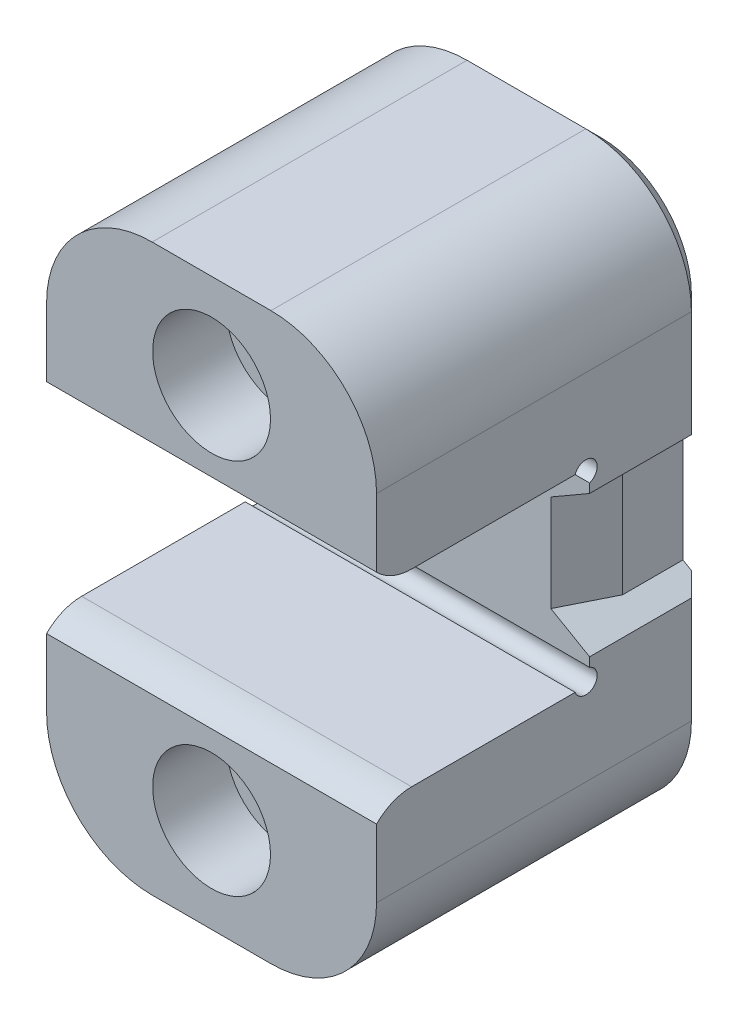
ISO-10303-21;
HEADER;
FILE_DESCRIPTION(('STEP AP214'),'2;1');
FILE_NAME('part.step','',(''),(''),'','','');
FILE_SCHEMA(('AUTOMOTIVE_DESIGN { 1 0 10303 214 1 1 1 1 }'));
ENDSEC;
DATA;
#1=APPLICATION_CONTEXT('core data for automotive mechanical design processes');
#2=APPLICATION_PROTOCOL_DEFINITION('international standard','automotive_design',2000,#1);
#3=PRODUCT_CONTEXT('',#1,'mechanical');
#4=PRODUCT('Part','Part','',(#3));
#5=PRODUCT_RELATED_PRODUCT_CATEGORY('part','',(#4));
#6=PRODUCT_DEFINITION_FORMATION('','',#4);
#7=PRODUCT_DEFINITION_CONTEXT('part definition',#1,'design');
#8=PRODUCT_DEFINITION('design','',#6,#7);
#9=PRODUCT_DEFINITION_SHAPE('','',#8);
#10=(LENGTH_UNIT() NAMED_UNIT(*) SI_UNIT(.MILLI.,.METRE.));
#11=(NAMED_UNIT(*) PLANE_ANGLE_UNIT() SI_UNIT($,.RADIAN.));
#12=(NAMED_UNIT(*) SI_UNIT($,.STERADIAN.) SOLID_ANGLE_UNIT());
#13=UNCERTAINTY_MEASURE_WITH_UNIT(LENGTH_MEASURE(1.E-05),#10,'distance_accuracy_value','');
#14=(GEOMETRIC_REPRESENTATION_CONTEXT(3) GLOBAL_UNCERTAINTY_ASSIGNED_CONTEXT((#13)) GLOBAL_UNIT_ASSIGNED_CONTEXT((#10,
#11,#12)) REPRESENTATION_CONTEXT('',''));
#15=CARTESIAN_POINT('',(0.,0.,0.));
#16=DIRECTION('',(0.,0.,1.));
#17=DIRECTION('',(1.,0.,0.));
#18=AXIS2_PLACEMENT_3D('',#15,#16,#17);
#19=CARTESIAN_POINT('',(11.1125,6.35,-14.351));
#20=DIRECTION('',(0.,0.,-1.));
#21=DIRECTION('',(-1.,0.,0.));
#22=AXIS2_PLACEMENT_3D('',#19,#20,#21);
#23=PLANE('',#22);
#24=DIRECTION('',(0.866025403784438,-0.500000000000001,0.));
#25=VECTOR('',#24,1.);
#26=CARTESIAN_POINT('',(6.30064635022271,-1.98437499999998,-14.351));
#27=LINE('',#26,#25);
#28=CARTESIAN_POINT('',(8.50411357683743,-3.25654739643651,-14.351));
#29=VERTEX_POINT('',#28);
#30=CARTESIAN_POINT('',(11.1125,-4.76249999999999,-14.351));
#31=VERTEX_POINT('',#30);
#32=EDGE_CURVE('E427',#29,#31,#27,.T.);
#33=ORIENTED_EDGE('',*,*,#32,.F.);
#34=DIRECTION('',(0.,1.,0.));
#35=VECTOR('',#34,1.);
#36=CARTESIAN_POINT('',(8.50411357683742,3.84595644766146,-14.351));
#37=LINE('',#36,#35);
#38=CARTESIAN_POINT('',(8.50411357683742,3.25654739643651,-14.351));
#39=VERTEX_POINT('',#38);
#40=EDGE_CURVE('E285',#29,#39,#37,.T.);
#41=ORIENTED_EDGE('',*,*,#40,.T.);
#42=DIRECTION('',(-0.866025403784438,-0.500000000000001,0.));
#43=VECTOR('',#42,1.);
#44=CARTESIAN_POINT('',(11.7999076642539,5.159375,-14.351));
#45=LINE('',#44,#43);
#46=CARTESIAN_POINT('',(11.1125,4.7625,-14.351));
#47=VERTEX_POINT('',#46);
#48=EDGE_CURVE('E425',#47,#39,#45,.T.);
#49=ORIENTED_EDGE('',*,*,#48,.F.);
#50=DIRECTION('',(0.,-1.,0.));
#51=VECTOR('',#50,1.);
#52=CARTESIAN_POINT('',(11.1125,6.35,-14.351));
#53=LINE('',#52,#51);
#54=CARTESIAN_POINT('',(11.1125,5.37757951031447,-14.351));
#55=VERTEX_POINT('',#54);
#56=EDGE_CURVE('E436',#55,#47,#53,.T.);
#57=ORIENTED_EDGE('',*,*,#56,.F.);
#58=DIRECTION('',(1.,0.,0.));
#59=VECTOR('',#58,1.);
#60=CARTESIAN_POINT('',(-11.1125,5.37757951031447,-14.351));
#61=LINE('',#60,#59);
#62=CARTESIAN_POINT('',(-11.1125,5.37757951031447,-14.351));
#63=VERTEX_POINT('',#62);
#64=EDGE_CURVE('E391',#55,#63,#61,.F.);
#65=ORIENTED_EDGE('',*,*,#64,.T.);
#66=DIRECTION('',(0.,-1.,0.));
#67=VECTOR('',#66,1.);
#68=CARTESIAN_POINT('',(-11.1125,6.35,-14.351));
#69=LINE('',#68,#67);
#70=CARTESIAN_POINT('',(-11.1125,-5.37757951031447,-14.351));
#71=VERTEX_POINT('',#70);
#72=EDGE_CURVE('E232',#63,#71,#69,.T.);
#73=ORIENTED_EDGE('',*,*,#72,.T.);
#74=DIRECTION('',(1.,0.,0.));
#75=VECTOR('',#74,1.);
#76=CARTESIAN_POINT('',(-11.1125,-5.37757951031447,-14.351));
#77=LINE('',#76,#75);
#78=CARTESIAN_POINT('',(11.1125,-5.37757951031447,-14.351));
#79=VERTEX_POINT('',#78);
#80=EDGE_CURVE('E212',#71,#79,#77,.T.);
#81=ORIENTED_EDGE('',*,*,#80,.T.);
#82=EDGE_CURVE('E435',#31,#79,#53,.T.);
#83=ORIENTED_EDGE('',*,*,#82,.F.);
#84=EDGE_LOOP('',(#33,#41,#49,#57,#65,#73,#81,#83));
#85=FACE_BOUND('',#84,.T.);
#86=ADVANCED_FACE('F32',(#85),#23,.F.);
#87=CARTESIAN_POINT('',(11.1125,19.05,-22.225));
#88=DIRECTION('',(0.,0.,1.));
#89=DIRECTION('',(1.,0.,0.));
#90=AXIS2_PLACEMENT_3D('',#87,#88,#89);
#91=PLANE('',#90);
#92=DIRECTION('',(0.866025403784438,-0.500000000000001,0.));
#93=VECTOR('',#92,1.);
#94=CARTESIAN_POINT('',(9.525,-3.84595644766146,-22.225));
#95=LINE('',#94,#93);
#96=CARTESIAN_POINT('',(9.525,-3.84595644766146,-22.225));
#97=VERTEX_POINT('',#96);
#98=CARTESIAN_POINT('',(10.0965,-4.17591212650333,-22.225));
#99=VERTEX_POINT('',#98);
#100=EDGE_CURVE('E415',#97,#99,#95,.T.);
#101=ORIENTED_EDGE('',*,*,#100,.T.);
#102=DIRECTION('',(0.,-1.,0.));
#103=VECTOR('',#102,1.);
#104=CARTESIAN_POINT('',(10.0965,19.05,-22.225));
#105=LINE('',#104,#103);
#106=CARTESIAN_POINT('',(10.0965,-11.938,-22.225));
#107=VERTEX_POINT('',#106);
#108=EDGE_CURVE('E314',#99,#107,#105,.T.);
#109=ORIENTED_EDGE('',*,*,#108,.T.);
#110=CARTESIAN_POINT('',(4.0005,-11.938,-22.225));
#111=DIRECTION('',(0.,0.,1.));
#112=DIRECTION('',(1.,0.,0.));
#113=AXIS2_PLACEMENT_3D('',#110,#111,#112);
#114=CIRCLE('',#113,6.096);
#115=CARTESIAN_POINT('',(4.0005,-18.034,-22.225));
#116=VERTEX_POINT('',#115);
#117=EDGE_CURVE('E310',#107,#116,#114,.F.);
#118=ORIENTED_EDGE('',*,*,#117,.T.);
#119=DIRECTION('',(-1.,0.,0.));
#120=VECTOR('',#119,1.);
#121=CARTESIAN_POINT('',(11.1125,-18.034,-22.225));
#122=LINE('',#121,#120);
#123=CARTESIAN_POINT('',(-4.0005,-18.034,-22.225));
#124=VERTEX_POINT('',#123);
#125=EDGE_CURVE('E306',#116,#124,#122,.T.);
#126=ORIENTED_EDGE('',*,*,#125,.T.);
#127=CARTESIAN_POINT('',(-4.0005,-11.938,-22.225));
#128=DIRECTION('',(0.,0.,1.));
#129=DIRECTION('',(1.,0.,0.));
#130=AXIS2_PLACEMENT_3D('',#127,#128,#129);
#131=CIRCLE('',#130,6.09599999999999);
#132=CARTESIAN_POINT('',(-10.0965,-11.938,-22.225));
#133=VERTEX_POINT('',#132);
#134=EDGE_CURVE('E304',#124,#133,#131,.F.);
#135=ORIENTED_EDGE('',*,*,#134,.T.);
#136=DIRECTION('',(0.,1.,0.));
#137=VECTOR('',#136,1.);
#138=CARTESIAN_POINT('',(-10.0965,11.938,-22.225));
#139=LINE('',#138,#137);
#140=CARTESIAN_POINT('',(-10.0965,11.938,-22.225));
#141=VERTEX_POINT('',#140);
#142=EDGE_CURVE('E300',#133,#141,#139,.T.);
#143=ORIENTED_EDGE('',*,*,#142,.T.);
#144=CARTESIAN_POINT('',(-4.0005,11.938,-22.225));
#145=DIRECTION('',(0.,0.,1.));
#146=DIRECTION('',(1.,0.,0.));
#147=AXIS2_PLACEMENT_3D('',#144,#145,#146);
#148=CIRCLE('',#147,6.09599999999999);
#149=CARTESIAN_POINT('',(-4.0005,18.034,-22.225));
#150=VERTEX_POINT('',#149);
#151=EDGE_CURVE('E298',#141,#150,#148,.F.);
#152=ORIENTED_EDGE('',*,*,#151,.T.);
#153=DIRECTION('',(1.,0.,0.));
#154=VECTOR('',#153,1.);
#155=CARTESIAN_POINT('',(11.1125,18.034,-22.225));
#156=LINE('',#155,#154);
#157=CARTESIAN_POINT('',(4.0005,18.034,-22.225));
#158=VERTEX_POINT('',#157);
#159=EDGE_CURVE('E302',#150,#158,#156,.T.);
#160=ORIENTED_EDGE('',*,*,#159,.T.);
#161=CARTESIAN_POINT('',(4.0005,11.938,-22.225));
#162=DIRECTION('',(0.,0.,1.));
#163=DIRECTION('',(1.,0.,0.));
#164=AXIS2_PLACEMENT_3D('',#161,#162,#163);
#165=CIRCLE('',#164,6.096);
#166=CARTESIAN_POINT('',(10.0965,11.938,-22.225));
#167=VERTEX_POINT('',#166);
#168=EDGE_CURVE('E308',#158,#167,#165,.F.);
#169=ORIENTED_EDGE('',*,*,#168,.T.);
#170=DIRECTION('',(0.,-1.,0.));
#171=VECTOR('',#170,1.);
#172=CARTESIAN_POINT('',(10.0965,19.05,-22.225));
#173=LINE('',#172,#171);
#174=CARTESIAN_POINT('',(10.0965,4.17591212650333,-22.225));
#175=VERTEX_POINT('',#174);
#176=EDGE_CURVE('E312',#167,#175,#173,.T.);
#177=ORIENTED_EDGE('',*,*,#176,.T.);
#178=DIRECTION('',(-0.866025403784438,-0.500000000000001,0.));
#179=VECTOR('',#178,1.);
#180=CARTESIAN_POINT('',(9.525,3.84595644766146,-22.225));
#181=LINE('',#180,#179);
#182=CARTESIAN_POINT('',(9.525,3.84595644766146,-22.225));
#183=VERTEX_POINT('',#182);
#184=EDGE_CURVE('E418',#175,#183,#181,.T.);
#185=ORIENTED_EDGE('',*,*,#184,.T.);
#186=DIRECTION('',(0.,-1.,0.));
#187=VECTOR('',#186,1.);
#188=CARTESIAN_POINT('',(9.525,3.84595644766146,-22.225));
#189=LINE('',#188,#187);
#190=EDGE_CURVE('E411',#183,#97,#189,.T.);
#191=ORIENTED_EDGE('',*,*,#190,.T.);
#192=EDGE_LOOP('',(#101,#109,#118,#126,#135,#143,#152,#160,#169,#177,#185,#191));
#193=FACE_BOUND('',#192,.T.);
#194=CARTESIAN_POINT('',(0.,12.7,-22.225));
#195=DIRECTION('',(0.,0.,1.));
#196=DIRECTION('',(1.,0.,0.));
#197=AXIS2_PLACEMENT_3D('',#194,#195,#196);
#198=CIRCLE('',#197,2.0193);
#199=CARTESIAN_POINT('',(2.0193,12.7,-22.225));
#200=VERTEX_POINT('',#199);
#201=EDGE_CURVE('E359',#200,#200,#198,.T.);
#202=ORIENTED_EDGE('',*,*,#201,.T.);
#203=EDGE_LOOP('',(#202));
#204=FACE_BOUND('',#203,.T.);
#205=CARTESIAN_POINT('',(0.,-12.7,-22.225));
#206=DIRECTION('',(0.,0.,1.));
#207=DIRECTION('',(1.,0.,0.));
#208=AXIS2_PLACEMENT_3D('',#205,#206,#207);
#209=CIRCLE('',#208,2.0193);
#210=CARTESIAN_POINT('',(2.0193,-12.7,-22.225));
#211=VERTEX_POINT('',#210);
#212=EDGE_CURVE('E369',#211,#211,#209,.T.);
#213=ORIENTED_EDGE('',*,*,#212,.T.);
#214=EDGE_LOOP('',(#213));
#215=FACE_BOUND('',#214,.T.);
#216=ADVANCED_FACE('F545',(#193,#204,#215),#91,.F.);
#217=CARTESIAN_POINT('',(11.1125,-6.35,0.));
#218=DIRECTION('',(-1.,0.,0.));
#219=DIRECTION('',(0.,0.,1.));
#220=AXIS2_PLACEMENT_3D('',#217,#218,#219);
#221=PLANE('',#220);
#222=DIRECTION('',(0.,0.,-1.));
#223=VECTOR('',#222,1.);
#224=CARTESIAN_POINT('',(11.1125,-11.938,0.));
#225=LINE('',#224,#223);
#226=CARTESIAN_POINT('',(11.1125,-11.938,0.));
#227=VERTEX_POINT('',#226);
#228=CARTESIAN_POINT('',(11.1125,-11.938,-21.209));
#229=VERTEX_POINT('',#228);
#230=EDGE_CURVE('E250',#227,#229,#225,.T.);
#231=ORIENTED_EDGE('',*,*,#230,.T.);
#232=DIRECTION('',(0.,1.,0.));
#233=VECTOR('',#232,1.);
#234=CARTESIAN_POINT('',(11.1125,-6.35,-21.209));
#235=LINE('',#234,#233);
#236=CARTESIAN_POINT('',(11.1125,-4.76249999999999,-21.209));
#237=VERTEX_POINT('',#236);
#238=EDGE_CURVE('E293',#229,#237,#235,.T.);
#239=ORIENTED_EDGE('',*,*,#238,.T.);
#240=DIRECTION('',(0.,0.,-1.));
#241=VECTOR('',#240,1.);
#242=CARTESIAN_POINT('',(11.1125,-4.76249999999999,0.));
#243=LINE('',#242,#241);
#244=EDGE_CURVE('E277',#31,#237,#243,.T.);
#245=ORIENTED_EDGE('',*,*,#244,.F.);
#246=ORIENTED_EDGE('',*,*,#82,.T.);
#247=CARTESIAN_POINT('',(11.1125,-6.096,-14.097));
#248=DIRECTION('',(1.,0.,0.));
#249=DIRECTION('',(0.,0.,1.));
#250=AXIS2_PLACEMENT_3D('',#247,#248,#249);
#251=CIRCLE('',#250,0.762000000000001);
#252=CARTESIAN_POINT('',(11.1125,-6.35,-13.3785795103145));
#253=VERTEX_POINT('',#252);
#254=EDGE_CURVE('E217',#253,#79,#251,.T.);
#255=ORIENTED_EDGE('',*,*,#254,.F.);
#256=DIRECTION('',(0.,0.,1.));
#257=VECTOR('',#256,1.);
#258=CARTESIAN_POINT('',(11.1125,-6.35,-14.351));
#259=LINE('',#258,#257);
#260=CARTESIAN_POINT('',(11.1125,-6.35,-2.36219999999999));
#261=VERTEX_POINT('',#260);
#262=EDGE_CURVE('E225',#253,#261,#259,.T.);
#263=ORIENTED_EDGE('',*,*,#262,.T.);
#264=CARTESIAN_POINT('',(11.1125,-9.64915342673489,-2.36219999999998));
#265=DIRECTION('',(-1.,0.,0.));
#266=DIRECTION('',(0.,0.,1.));
#267=AXIS2_PLACEMENT_3D('',#264,#265,#266);
#268=CIRCLE('',#267,3.29915342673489);
#269=CARTESIAN_POINT('',(11.1125,-7.3460198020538,0.));
#270=VERTEX_POINT('',#269);
#271=EDGE_CURVE('E402',#270,#261,#268,.T.);
#272=ORIENTED_EDGE('',*,*,#271,.F.);
#273=DIRECTION('',(0.,-1.,0.));
#274=VECTOR('',#273,1.);
#275=CARTESIAN_POINT('',(11.1125,-6.35,0.));
#276=LINE('',#275,#274);
#277=EDGE_CURVE('E245',#270,#227,#276,.T.);
#278=ORIENTED_EDGE('',*,*,#277,.T.);
#279=EDGE_LOOP('',(#231,#239,#245,#246,#255,#263,#272,#278));
#280=FACE_BOUND('',#279,.T.);
#281=ADVANCED_FACE('F522',(#280),#221,.F.);
#282=DIRECTION('',(0.,0.,1.));
#283=VECTOR('',#282,1.);
#284=CARTESIAN_POINT('',(11.1125,4.7625,0.));
#285=LINE('',#284,#283);
#286=CARTESIAN_POINT('',(11.1125,4.7625,-21.209));
#287=VERTEX_POINT('',#286);
#288=EDGE_CURVE('E275',#287,#47,#285,.T.);
#289=ORIENTED_EDGE('',*,*,#288,.F.);
#290=DIRECTION('',(0.,1.,0.));
#291=VECTOR('',#290,1.);
#292=CARTESIAN_POINT('',(11.1125,-6.35,-21.209));
#293=LINE('',#292,#291);
#294=CARTESIAN_POINT('',(11.1125,11.938,-21.209));
#295=VERTEX_POINT('',#294);
#296=EDGE_CURVE('E316',#287,#295,#293,.T.);
#297=ORIENTED_EDGE('',*,*,#296,.T.);
#298=DIRECTION('',(0.,0.,1.));
#299=VECTOR('',#298,1.);
#300=CARTESIAN_POINT('',(11.1125,11.938,0.));
#301=LINE('',#300,#299);
#302=CARTESIAN_POINT('',(11.1125,11.938,0.));
#303=VERTEX_POINT('',#302);
#304=EDGE_CURVE('E248',#295,#303,#301,.T.);
#305=ORIENTED_EDGE('',*,*,#304,.T.);
#306=DIRECTION('',(0.,-1.,0.));
#307=VECTOR('',#306,1.);
#308=CARTESIAN_POINT('',(11.1125,19.05,0.));
#309=LINE('',#308,#307);
#310=CARTESIAN_POINT('',(11.1125,7.3460198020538,0.));
#311=VERTEX_POINT('',#310);
#312=EDGE_CURVE('E235',#303,#311,#309,.T.);
#313=ORIENTED_EDGE('',*,*,#312,.T.);
#314=CARTESIAN_POINT('',(11.1125,9.64915342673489,-2.36219999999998));
#315=DIRECTION('',(-1.,0.,0.));
#316=DIRECTION('',(0.,0.,-1.));
#317=AXIS2_PLACEMENT_3D('',#314,#315,#316);
#318=CIRCLE('',#317,3.29915342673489);
#319=CARTESIAN_POINT('',(11.1125,6.35,-2.36219999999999));
#320=VERTEX_POINT('',#319);
#321=EDGE_CURVE('E394',#320,#311,#318,.T.);
#322=ORIENTED_EDGE('',*,*,#321,.F.);
#323=DIRECTION('',(0.,0.,-1.));
#324=VECTOR('',#323,1.);
#325=CARTESIAN_POINT('',(11.1125,6.35,0.));
#326=LINE('',#325,#324);
#327=CARTESIAN_POINT('',(11.1125,6.35,-13.3785795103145));
#328=VERTEX_POINT('',#327);
#329=EDGE_CURVE('E432',#320,#328,#326,.T.);
#330=ORIENTED_EDGE('',*,*,#329,.T.);
#331=CARTESIAN_POINT('',(11.1125,6.096,-14.097));
#332=DIRECTION('',(1.,0.,0.));
#333=DIRECTION('',(0.,0.,-1.));
#334=AXIS2_PLACEMENT_3D('',#331,#332,#333);
#335=CIRCLE('',#334,0.762000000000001);
#336=EDGE_CURVE('E386',#55,#328,#335,.T.);
#337=ORIENTED_EDGE('',*,*,#336,.F.);
#338=ORIENTED_EDGE('',*,*,#56,.T.);
#339=EDGE_LOOP('',(#289,#297,#305,#313,#322,#330,#337,#338));
#340=FACE_BOUND('',#339,.T.);
#341=ADVANCED_FACE('F458',(#340),#221,.F.);
#342=CARTESIAN_POINT('',(11.1125,19.05,0.));
#343=DIRECTION('',(0.,0.,-1.));
#344=DIRECTION('',(0.,1.,0.));
#345=AXIS2_PLACEMENT_3D('',#342,#343,#344);
#346=PLANE('',#345);
#347=CARTESIAN_POINT('',(0.,12.7,0.));
#348=DIRECTION('',(0.,0.,1.));
#349=DIRECTION('',(1.,0.,0.));
#350=AXIS2_PLACEMENT_3D('',#347,#348,#349);
#351=CIRCLE('',#350,3.96875);
#352=CARTESIAN_POINT('',(3.96875,12.7,0.));
#353=VERTEX_POINT('',#352);
#354=EDGE_CURVE('E372',#353,#353,#351,.T.);
#355=ORIENTED_EDGE('',*,*,#354,.F.);
#356=EDGE_LOOP('',(#355));
#357=FACE_BOUND('',#356,.T.);
#358=DIRECTION('',(0.,-1.,0.));
#359=VECTOR('',#358,1.);
#360=CARTESIAN_POINT('',(-11.1125,19.05,0.));
#361=LINE('',#360,#359);
#362=CARTESIAN_POINT('',(-11.1125,11.938,0.));
#363=VERTEX_POINT('',#362);
#364=CARTESIAN_POINT('',(-11.1125,7.3460198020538,0.));
#365=VERTEX_POINT('',#364);
#366=EDGE_CURVE('E429',#363,#365,#361,.T.);
#367=ORIENTED_EDGE('',*,*,#366,.T.);
#368=DIRECTION('',(1.,0.,0.));
#369=VECTOR('',#368,1.);
#370=CARTESIAN_POINT('',(-11.1125,7.3460198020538,0.));
#371=LINE('',#370,#369);
#372=EDGE_CURVE('E398',#365,#311,#371,.T.);
#373=ORIENTED_EDGE('',*,*,#372,.T.);
#374=ORIENTED_EDGE('',*,*,#312,.F.);
#375=CARTESIAN_POINT('',(4.0005,11.938,0.));
#376=DIRECTION('',(0.,0.,-1.));
#377=DIRECTION('',(0.,1.,0.));
#378=AXIS2_PLACEMENT_3D('',#375,#376,#377);
#379=CIRCLE('',#378,7.112);
#380=CARTESIAN_POINT('',(4.0005,19.05,0.));
#381=VERTEX_POINT('',#380);
#382=EDGE_CURVE('E265',#303,#381,#379,.F.);
#383=ORIENTED_EDGE('',*,*,#382,.T.);
#384=DIRECTION('',(-1.,0.,0.));
#385=VECTOR('',#384,1.);
#386=CARTESIAN_POINT('',(11.1125,19.05,0.));
#387=LINE('',#386,#385);
#388=CARTESIAN_POINT('',(-4.0005,19.05,0.));
#389=VERTEX_POINT('',#388);
#390=EDGE_CURVE('E241',#381,#389,#387,.T.);
#391=ORIENTED_EDGE('',*,*,#390,.T.);
#392=CARTESIAN_POINT('',(-4.0005,11.938,0.));
#393=DIRECTION('',(0.,0.,-1.));
#394=DIRECTION('',(0.,1.,0.));
#395=AXIS2_PLACEMENT_3D('',#392,#393,#394);
#396=CIRCLE('',#395,7.112);
#397=EDGE_CURVE('E263',#389,#363,#396,.F.);
#398=ORIENTED_EDGE('',*,*,#397,.T.);
#399=EDGE_LOOP('',(#367,#373,#374,#383,#391,#398));
#400=FACE_BOUND('',#399,.T.);
#401=ADVANCED_FACE('F465',(#357,#400),#346,.F.);
#402=CARTESIAN_POINT('',(11.1125,6.35,0.));
#403=DIRECTION('',(0.,1.,0.));
#404=DIRECTION('',(0.,0.,1.));
#405=AXIS2_PLACEMENT_3D('',#402,#403,#404);
#406=PLANE('',#405);
#407=DIRECTION('',(0.,0.,-1.));
#408=VECTOR('',#407,1.);
#409=CARTESIAN_POINT('',(-11.1125,6.35,0.));
#410=LINE('',#409,#408);
#411=CARTESIAN_POINT('',(-11.1125,6.35,-2.36219999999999));
#412=VERTEX_POINT('',#411);
#413=CARTESIAN_POINT('',(-11.1125,6.35,-13.3785795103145));
#414=VERTEX_POINT('',#413);
#415=EDGE_CURVE('E237',#412,#414,#410,.T.);
#416=ORIENTED_EDGE('',*,*,#415,.T.);
#417=DIRECTION('',(1.,0.,0.));
#418=VECTOR('',#417,1.);
#419=CARTESIAN_POINT('',(-11.1125,6.35,-13.3785795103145));
#420=LINE('',#419,#418);
#421=EDGE_CURVE('E388',#414,#328,#420,.T.);
#422=ORIENTED_EDGE('',*,*,#421,.T.);
#423=ORIENTED_EDGE('',*,*,#329,.F.);
#424=DIRECTION('',(1.,0.,0.));
#425=VECTOR('',#424,1.);
#426=CARTESIAN_POINT('',(-11.1125,6.35,-2.36219999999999));
#427=LINE('',#426,#425);
#428=EDGE_CURVE('E400',#412,#320,#427,.T.);
#429=ORIENTED_EDGE('',*,*,#428,.F.);
#430=EDGE_LOOP('',(#416,#422,#423,#429));
#431=FACE_BOUND('',#430,.T.);
#432=ADVANCED_FACE('F446',(#431),#406,.F.);
#433=CARTESIAN_POINT('',(11.1125,-6.35,-14.351));
#434=DIRECTION('',(0.,-1.,0.));
#435=DIRECTION('',(0.,0.,-1.));
#436=AXIS2_PLACEMENT_3D('',#433,#434,#435);
#437=PLANE('',#436);
#438=ORIENTED_EDGE('',*,*,#262,.F.);
#439=DIRECTION('',(1.,0.,0.));
#440=VECTOR('',#439,1.);
#441=CARTESIAN_POINT('',(-11.1125,-6.35,-13.3785795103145));
#442=LINE('',#441,#440);
#443=CARTESIAN_POINT('',(-11.1125,-6.35,-13.3785795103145));
#444=VERTEX_POINT('',#443);
#445=EDGE_CURVE('E209',#253,#444,#442,.F.);
#446=ORIENTED_EDGE('',*,*,#445,.T.);
#447=DIRECTION('',(0.,0.,1.));
#448=VECTOR('',#447,1.);
#449=CARTESIAN_POINT('',(-11.1125,-6.35,-14.351));
#450=LINE('',#449,#448);
#451=CARTESIAN_POINT('',(-11.1125,-6.35,-2.36219999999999));
#452=VERTEX_POINT('',#451);
#453=EDGE_CURVE('E223',#444,#452,#450,.T.);
#454=ORIENTED_EDGE('',*,*,#453,.T.);
#455=DIRECTION('',(1.,0.,0.));
#456=VECTOR('',#455,1.);
#457=CARTESIAN_POINT('',(-11.1125,-6.35,-2.36219999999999));
#458=LINE('',#457,#456);
#459=EDGE_CURVE('E406',#452,#261,#458,.T.);
#460=ORIENTED_EDGE('',*,*,#459,.T.);
#461=EDGE_LOOP('',(#438,#446,#454,#460));
#462=FACE_BOUND('',#461,.T.);
#463=ADVANCED_FACE('F221',(#462),#437,.F.);
#464=CARTESIAN_POINT('',(11.1125,-6.35,0.));
#465=DIRECTION('',(0.,0.,-1.));
#466=DIRECTION('',(0.,1.,0.));
#467=AXIS2_PLACEMENT_3D('',#464,#465,#466);
#468=PLANE('',#467);
#469=CARTESIAN_POINT('',(0.,-12.7,0.));
#470=DIRECTION('',(0.,0.,1.));
#471=DIRECTION('',(1.,0.,0.));
#472=AXIS2_PLACEMENT_3D('',#469,#470,#471);
#473=CIRCLE('',#472,3.96875);
#474=CARTESIAN_POINT('',(3.96875,-12.7,0.));
#475=VERTEX_POINT('',#474);
#476=EDGE_CURVE('E378',#475,#475,#473,.T.);
#477=ORIENTED_EDGE('',*,*,#476,.F.);
#478=EDGE_LOOP('',(#477));
#479=FACE_BOUND('',#478,.T.);
#480=ORIENTED_EDGE('',*,*,#277,.F.);
#481=DIRECTION('',(1.,0.,0.));
#482=VECTOR('',#481,1.);
#483=CARTESIAN_POINT('',(-11.1125,-7.3460198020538,0.));
#484=LINE('',#483,#482);
#485=CARTESIAN_POINT('',(-11.1125,-7.3460198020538,0.));
#486=VERTEX_POINT('',#485);
#487=EDGE_CURVE('E409',#486,#270,#484,.T.);
#488=ORIENTED_EDGE('',*,*,#487,.F.);
#489=DIRECTION('',(0.,-1.,0.));
#490=VECTOR('',#489,1.);
#491=CARTESIAN_POINT('',(-11.1125,-6.35,0.));
#492=LINE('',#491,#490);
#493=CARTESIAN_POINT('',(-11.1125,-11.938,0.));
#494=VERTEX_POINT('',#493);
#495=EDGE_CURVE('E231',#486,#494,#492,.T.);
#496=ORIENTED_EDGE('',*,*,#495,.T.);
#497=CARTESIAN_POINT('',(-4.0005,-11.938,0.));
#498=DIRECTION('',(0.,0.,-1.));
#499=DIRECTION('',(0.,1.,0.));
#500=AXIS2_PLACEMENT_3D('',#497,#498,#499);
#501=CIRCLE('',#500,7.112);
#502=CARTESIAN_POINT('',(-4.0005,-19.05,0.));
#503=VERTEX_POINT('',#502);
#504=EDGE_CURVE('E258',#494,#503,#501,.F.);
#505=ORIENTED_EDGE('',*,*,#504,.T.);
#506=DIRECTION('',(-1.,0.,0.));
#507=VECTOR('',#506,1.);
#508=CARTESIAN_POINT('',(11.1125,-19.05,0.));
#509=LINE('',#508,#507);
#510=CARTESIAN_POINT('',(4.0005,-19.05,0.));
#511=VERTEX_POINT('',#510);
#512=EDGE_CURVE('E244',#511,#503,#509,.T.);
#513=ORIENTED_EDGE('',*,*,#512,.F.);
#514=CARTESIAN_POINT('',(4.0005,-11.938,0.));
#515=DIRECTION('',(0.,0.,-1.));
#516=DIRECTION('',(0.,1.,0.));
#517=AXIS2_PLACEMENT_3D('',#514,#515,#516);
#518=CIRCLE('',#517,7.112);
#519=EDGE_CURVE('E260',#511,#227,#518,.F.);
#520=ORIENTED_EDGE('',*,*,#519,.T.);
#521=EDGE_LOOP('',(#480,#488,#496,#505,#513,#520));
#522=FACE_BOUND('',#521,.T.);
#523=ADVANCED_FACE('F496',(#479,#522),#468,.F.);
#524=CARTESIAN_POINT('',(11.1125,-19.05,0.));
#525=DIRECTION('',(0.,1.,0.));
#526=DIRECTION('',(0.,0.,1.));
#527=AXIS2_PLACEMENT_3D('',#524,#525,#526);
#528=PLANE('',#527);
#529=DIRECTION('',(0.,0.,-1.));
#530=VECTOR('',#529,1.);
#531=CARTESIAN_POINT('',(-4.0005,-19.05,-22.225));
#532=LINE('',#531,#530);
#533=CARTESIAN_POINT('',(-4.0005,-19.05,-21.209));
#534=VERTEX_POINT('',#533);
#535=EDGE_CURVE('E253',#503,#534,#532,.T.);
#536=ORIENTED_EDGE('',*,*,#535,.T.);
#537=DIRECTION('',(1.,0.,0.));
#538=VECTOR('',#537,1.);
#539=CARTESIAN_POINT('',(11.1125,-19.05,-21.209));
#540=LINE('',#539,#538);
#541=CARTESIAN_POINT('',(4.0005,-19.05,-21.209));
#542=VERTEX_POINT('',#541);
#543=EDGE_CURVE('E324',#534,#542,#540,.T.);
#544=ORIENTED_EDGE('',*,*,#543,.T.);
#545=DIRECTION('',(0.,0.,-1.));
#546=VECTOR('',#545,1.);
#547=CARTESIAN_POINT('',(4.0005,-19.05,0.));
#548=LINE('',#547,#546);
#549=EDGE_CURVE('E256',#542,#511,#548,.F.);
#550=ORIENTED_EDGE('',*,*,#549,.T.);
#551=ORIENTED_EDGE('',*,*,#512,.T.);
#552=EDGE_LOOP('',(#536,#544,#550,#551));
#553=FACE_BOUND('',#552,.T.);
#554=ADVANCED_FACE('F500',(#553),#528,.F.);
#555=CARTESIAN_POINT('',(11.1125,19.05,0.));
#556=DIRECTION('',(0.,-1.,0.));
#557=DIRECTION('',(0.,0.,-1.));
#558=AXIS2_PLACEMENT_3D('',#555,#556,#557);
#559=PLANE('',#558);
#560=DIRECTION('',(0.,0.,1.));
#561=VECTOR('',#560,1.);
#562=CARTESIAN_POINT('',(4.0005,19.05,0.));
#563=LINE('',#562,#561);
#564=CARTESIAN_POINT('',(4.0005,19.05,-21.209));
#565=VERTEX_POINT('',#564);
#566=EDGE_CURVE('E269',#381,#565,#563,.F.);
#567=ORIENTED_EDGE('',*,*,#566,.T.);
#568=DIRECTION('',(-1.,0.,0.));
#569=VECTOR('',#568,1.);
#570=CARTESIAN_POINT('',(11.1125,19.05,-21.209));
#571=LINE('',#570,#569);
#572=CARTESIAN_POINT('',(-4.0005,19.05,-21.209));
#573=VERTEX_POINT('',#572);
#574=EDGE_CURVE('E55',#565,#573,#571,.T.);
#575=ORIENTED_EDGE('',*,*,#574,.T.);
#576=DIRECTION('',(0.,0.,1.));
#577=VECTOR('',#576,1.);
#578=CARTESIAN_POINT('',(-4.0005,19.05,0.));
#579=LINE('',#578,#577);
#580=EDGE_CURVE('E267',#573,#389,#579,.T.);
#581=ORIENTED_EDGE('',*,*,#580,.T.);
#582=ORIENTED_EDGE('',*,*,#390,.F.);
#583=EDGE_LOOP('',(#567,#575,#581,#582));
#584=FACE_BOUND('',#583,.T.);
#585=ADVANCED_FACE('F473',(#584),#559,.F.);
#586=CARTESIAN_POINT('',(-11.1125,-6.35,0.));
#587=DIRECTION('',(-1.,0.,0.));
#588=DIRECTION('',(0.,0.,1.));
#589=AXIS2_PLACEMENT_3D('',#586,#587,#588);
#590=PLANE('',#589);
#591=DIRECTION('',(0.,0.,1.));
#592=VECTOR('',#591,1.);
#593=CARTESIAN_POINT('',(-11.1125,11.938,-22.225));
#594=LINE('',#593,#592);
#595=CARTESIAN_POINT('',(-11.1125,11.938,-21.209));
#596=VERTEX_POINT('',#595);
#597=EDGE_CURVE('E271',#363,#596,#594,.F.);
#598=ORIENTED_EDGE('',*,*,#597,.T.);
#599=DIRECTION('',(0.,-1.,0.));
#600=VECTOR('',#599,1.);
#601=CARTESIAN_POINT('',(-11.1125,-11.938,-21.209));
#602=LINE('',#601,#600);
#603=CARTESIAN_POINT('',(-11.1125,-11.938,-21.209));
#604=VERTEX_POINT('',#603);
#605=EDGE_CURVE('E41',#596,#604,#602,.T.);
#606=ORIENTED_EDGE('',*,*,#605,.T.);
#607=DIRECTION('',(0.,0.,-1.));
#608=VECTOR('',#607,1.);
#609=CARTESIAN_POINT('',(-11.1125,-11.938,0.));
#610=LINE('',#609,#608);
#611=EDGE_CURVE('E273',#604,#494,#610,.F.);
#612=ORIENTED_EDGE('',*,*,#611,.T.);
#613=ORIENTED_EDGE('',*,*,#495,.F.);
#614=CARTESIAN_POINT('',(-11.1125,-9.64915342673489,-2.36219999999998));
#615=DIRECTION('',(-1.,0.,0.));
#616=DIRECTION('',(0.,0.,1.));
#617=AXIS2_PLACEMENT_3D('',#614,#615,#616);
#618=CIRCLE('',#617,3.29915342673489);
#619=EDGE_CURVE('E230',#486,#452,#618,.T.);
#620=ORIENTED_EDGE('',*,*,#619,.T.);
#621=ORIENTED_EDGE('',*,*,#453,.F.);
#622=CARTESIAN_POINT('',(-11.1125,-6.096,-14.097));
#623=DIRECTION('',(1.,0.,0.));
#624=DIRECTION('',(0.,0.,1.));
#625=AXIS2_PLACEMENT_3D('',#622,#623,#624);
#626=CIRCLE('',#625,0.762000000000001);
#627=EDGE_CURVE('E206',#444,#71,#626,.T.);
#628=ORIENTED_EDGE('',*,*,#627,.T.);
#629=ORIENTED_EDGE('',*,*,#72,.F.);
#630=CARTESIAN_POINT('',(-11.1125,6.096,-14.097));
#631=DIRECTION('',(-1.,0.,0.));
#632=DIRECTION('',(0.,0.,1.));
#633=AXIS2_PLACEMENT_3D('',#630,#631,#632);
#634=CIRCLE('',#633,0.762000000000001);
#635=EDGE_CURVE('E280',#414,#63,#634,.T.);
#636=ORIENTED_EDGE('',*,*,#635,.F.);
#637=ORIENTED_EDGE('',*,*,#415,.F.);
#638=CARTESIAN_POINT('',(-11.1125,9.64915342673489,-2.36219999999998));
#639=DIRECTION('',(-1.,0.,0.));
#640=DIRECTION('',(0.,0.,-1.));
#641=AXIS2_PLACEMENT_3D('',#638,#639,#640);
#642=CIRCLE('',#641,3.29915342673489);
#643=EDGE_CURVE('E395',#412,#365,#642,.T.);
#644=ORIENTED_EDGE('',*,*,#643,.T.);
#645=ORIENTED_EDGE('',*,*,#366,.F.);
#646=EDGE_LOOP('',(#598,#606,#612,#613,#620,#621,#628,#629,#636,#637,#644,#645));
#647=FACE_BOUND('',#646,.T.);
#648=ADVANCED_FACE('F228',(#647),#590,.T.);
#649=CARTESIAN_POINT('',(4.0005,-11.938,0.));
#650=DIRECTION('',(0.,0.,-1.));
#651=DIRECTION('',(-1.,0.,0.));
#652=AXIS2_PLACEMENT_3D('',#649,#650,#651);
#653=CYLINDRICAL_SURFACE('',#652,7.112);
#654=ORIENTED_EDGE('',*,*,#549,.F.);
#655=CARTESIAN_POINT('',(4.0005,-11.938,-21.209));
#656=DIRECTION('',(0.,0.,1.));
#657=DIRECTION('',(1.,0.,0.));
#658=AXIS2_PLACEMENT_3D('',#655,#656,#657);
#659=CIRCLE('',#658,7.112);
#660=EDGE_CURVE('E320',#542,#229,#659,.T.);
#661=ORIENTED_EDGE('',*,*,#660,.T.);
#662=ORIENTED_EDGE('',*,*,#230,.F.);
#663=ORIENTED_EDGE('',*,*,#519,.F.);
#664=EDGE_LOOP('',(#654,#661,#662,#663));
#665=FACE_BOUND('',#664,.T.);
#666=ADVANCED_FACE('F506',(#665),#653,.T.);
#667=CARTESIAN_POINT('',(4.0005,11.938,0.));
#668=DIRECTION('',(0.,0.,1.));
#669=DIRECTION('',(1.,0.,0.));
#670=AXIS2_PLACEMENT_3D('',#667,#668,#669);
#671=CYLINDRICAL_SURFACE('',#670,7.112);
#672=ORIENTED_EDGE('',*,*,#304,.F.);
#673=CARTESIAN_POINT('',(4.0005,11.938,-21.209));
#674=DIRECTION('',(0.,0.,1.));
#675=DIRECTION('',(1.,0.,0.));
#676=AXIS2_PLACEMENT_3D('',#673,#674,#675);
#677=CIRCLE('',#676,7.112);
#678=EDGE_CURVE('E322',#295,#565,#677,.T.);
#679=ORIENTED_EDGE('',*,*,#678,.T.);
#680=ORIENTED_EDGE('',*,*,#566,.F.);
#681=ORIENTED_EDGE('',*,*,#382,.F.);
#682=EDGE_LOOP('',(#672,#679,#680,#681));
#683=FACE_BOUND('',#682,.T.);
#684=ADVANCED_FACE('F476',(#683),#671,.T.);
#685=CARTESIAN_POINT('',(-4.0005,-11.938,0.));
#686=DIRECTION('',(0.,0.,1.));
#687=DIRECTION('',(1.,0.,0.));
#688=AXIS2_PLACEMENT_3D('',#685,#686,#687);
#689=CYLINDRICAL_SURFACE('',#688,7.112);
#690=ORIENTED_EDGE('',*,*,#611,.F.);
#691=CARTESIAN_POINT('',(-4.0005,-11.938,-21.209));
#692=DIRECTION('',(0.,0.,1.));
#693=DIRECTION('',(1.,0.,0.));
#694=AXIS2_PLACEMENT_3D('',#691,#692,#693);
#695=CIRCLE('',#694,7.112);
#696=EDGE_CURVE('E326',#604,#534,#695,.T.);
#697=ORIENTED_EDGE('',*,*,#696,.T.);
#698=ORIENTED_EDGE('',*,*,#535,.F.);
#699=ORIENTED_EDGE('',*,*,#504,.F.);
#700=EDGE_LOOP('',(#690,#697,#698,#699));
#701=FACE_BOUND('',#700,.T.);
#702=ADVANCED_FACE('F491',(#701),#689,.T.);
#703=CARTESIAN_POINT('',(-4.0005,11.938,0.));
#704=DIRECTION('',(0.,0.,-1.));
#705=DIRECTION('',(-1.,0.,0.));
#706=AXIS2_PLACEMENT_3D('',#703,#704,#705);
#707=CYLINDRICAL_SURFACE('',#706,7.112);
#708=ORIENTED_EDGE('',*,*,#580,.F.);
#709=CARTESIAN_POINT('',(-4.0005,11.938,-21.209));
#710=DIRECTION('',(0.,0.,1.));
#711=DIRECTION('',(1.,0.,0.));
#712=AXIS2_PLACEMENT_3D('',#709,#710,#711);
#713=CIRCLE('',#712,7.112);
#714=EDGE_CURVE('E11',#573,#596,#713,.T.);
#715=ORIENTED_EDGE('',*,*,#714,.T.);
#716=ORIENTED_EDGE('',*,*,#597,.F.);
#717=ORIENTED_EDGE('',*,*,#397,.F.);
#718=EDGE_LOOP('',(#708,#715,#716,#717));
#719=FACE_BOUND('',#718,.T.);
#720=ADVANCED_FACE('F468',(#719),#707,.T.);
#721=CARTESIAN_POINT('',(9.525,3.84595644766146,0.));
#722=DIRECTION('',(1.,0.,0.));
#723=DIRECTION('',(0.,1.,0.));
#724=AXIS2_PLACEMENT_3D('',#721,#722,#723);
#725=PLANE('',#724);
#726=DIRECTION('',(0.,0.,-1.));
#727=VECTOR('',#726,1.);
#728=CARTESIAN_POINT('',(9.525,3.84595644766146,0.));
#729=LINE('',#728,#727);
#730=CARTESIAN_POINT('',(9.525,3.84595644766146,-18.161));
#731=VERTEX_POINT('',#730);
#732=EDGE_CURVE('E420',#731,#183,#729,.T.);
#733=ORIENTED_EDGE('',*,*,#732,.F.);
#734=DIRECTION('',(0.,-1.,0.));
#735=VECTOR('',#734,1.);
#736=CARTESIAN_POINT('',(9.525,-3.84595644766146,-18.161));
#737=LINE('',#736,#735);
#738=CARTESIAN_POINT('',(9.525,-3.84595644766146,-18.161));
#739=VERTEX_POINT('',#738);
#740=EDGE_CURVE('E282',#731,#739,#737,.T.);
#741=ORIENTED_EDGE('',*,*,#740,.T.);
#742=DIRECTION('',(0.,0.,-1.));
#743=VECTOR('',#742,1.);
#744=CARTESIAN_POINT('',(9.525,-3.84595644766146,0.));
#745=LINE('',#744,#743);
#746=EDGE_CURVE('E423',#739,#97,#745,.T.);
#747=ORIENTED_EDGE('',*,*,#746,.T.);
#748=ORIENTED_EDGE('',*,*,#190,.F.);
#749=EDGE_LOOP('',(#733,#741,#747,#748));
#750=FACE_BOUND('',#749,.T.);
#751=ADVANCED_FACE('F568',(#750),#725,.T.);
#752=CARTESIAN_POINT('',(9.525,-3.84595644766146,0.));
#753=DIRECTION('',(0.500000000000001,0.866025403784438,0.));
#754=DIRECTION('',(-0.866025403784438,0.500000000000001,0.));
#755=AXIS2_PLACEMENT_3D('',#752,#753,#754);
#756=PLANE('',#755);
#757=ORIENTED_EDGE('',*,*,#244,.T.);
#758=DIRECTION('',(0.654653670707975,-0.377964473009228,0.654653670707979));
#759=VECTOR('',#758,1.);
#760=CARTESIAN_POINT('',(19.2949285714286,-9.48662733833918,-13.0265714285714));
#761=LINE('',#760,#759);
#762=EDGE_CURVE('E296',#237,#99,#761,.F.);
#763=ORIENTED_EDGE('',*,*,#762,.T.);
#764=ORIENTED_EDGE('',*,*,#100,.F.);
#765=ORIENTED_EDGE('',*,*,#746,.F.);
#766=DIRECTION('',(-0.255976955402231,0.147788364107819,0.955319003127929));
#767=VECTOR('',#766,1.);
#768=CARTESIAN_POINT('',(9.23401173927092,-3.67795429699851,-17.075017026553));
#769=LINE('',#768,#767);
#770=EDGE_CURVE('E288',#739,#29,#769,.T.);
#771=ORIENTED_EDGE('',*,*,#770,.T.);
#772=ORIENTED_EDGE('',*,*,#32,.T.);
#773=EDGE_LOOP('',(#757,#763,#764,#765,#771,#772));
#774=FACE_BOUND('',#773,.T.);
#775=ADVANCED_FACE('F526',(#774),#756,.T.);
#776=CARTESIAN_POINT('',(9.525,3.84595644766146,0.));
#777=DIRECTION('',(0.500000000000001,-0.866025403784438,0.));
#778=DIRECTION('',(0.866025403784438,0.500000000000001,0.));
#779=AXIS2_PLACEMENT_3D('',#776,#777,#778);
#780=PLANE('',#779);
#781=ORIENTED_EDGE('',*,*,#184,.F.);
#782=DIRECTION('',(-0.654653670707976,-0.377964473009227,-0.654653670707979));
#783=VECTOR('',#782,1.);
#784=CARTESIAN_POINT('',(19.2949285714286,9.48662733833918,-13.0265714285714));
#785=LINE('',#784,#783);
#786=EDGE_CURVE('E318',#175,#287,#785,.F.);
#787=ORIENTED_EDGE('',*,*,#786,.T.);
#788=ORIENTED_EDGE('',*,*,#288,.T.);
#789=ORIENTED_EDGE('',*,*,#48,.T.);
#790=DIRECTION('',(0.255976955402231,0.147788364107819,-0.955319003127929));
#791=VECTOR('',#790,1.);
#792=CARTESIAN_POINT('',(9.525,3.84595644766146,-18.161));
#793=LINE('',#792,#791);
#794=EDGE_CURVE('E291',#39,#731,#793,.T.);
#795=ORIENTED_EDGE('',*,*,#794,.T.);
#796=ORIENTED_EDGE('',*,*,#732,.T.);
#797=EDGE_LOOP('',(#781,#787,#788,#789,#795,#796));
#798=FACE_BOUND('',#797,.T.);
#799=ADVANCED_FACE('F535',(#798),#780,.T.);
#800=CARTESIAN_POINT('',(-11.1125,-9.64915342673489,-2.36219999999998));
#801=DIRECTION('',(1.,0.,0.));
#802=DIRECTION('',(0.,0.,-1.));
#803=AXIS2_PLACEMENT_3D('',#800,#801,#802);
#804=CYLINDRICAL_SURFACE('',#803,3.29915342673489);
#805=ORIENTED_EDGE('',*,*,#271,.T.);
#806=ORIENTED_EDGE('',*,*,#459,.F.);
#807=ORIENTED_EDGE('',*,*,#619,.F.);
#808=ORIENTED_EDGE('',*,*,#487,.T.);
#809=EDGE_LOOP('',(#805,#806,#807,#808));
#810=FACE_BOUND('',#809,.T.);
#811=ADVANCED_FACE('F533',(#810),#804,.T.);
#812=CARTESIAN_POINT('',(-11.1125,9.64915342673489,-2.36219999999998));
#813=DIRECTION('',(1.,0.,0.));
#814=DIRECTION('',(0.,0.,-1.));
#815=AXIS2_PLACEMENT_3D('',#812,#813,#814);
#816=CYLINDRICAL_SURFACE('',#815,3.29915342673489);
#817=ORIENTED_EDGE('',*,*,#321,.T.);
#818=ORIENTED_EDGE('',*,*,#372,.F.);
#819=ORIENTED_EDGE('',*,*,#643,.F.);
#820=ORIENTED_EDGE('',*,*,#428,.T.);
#821=EDGE_LOOP('',(#817,#818,#819,#820));
#822=FACE_BOUND('',#821,.T.);
#823=ADVANCED_FACE('F463',(#822),#816,.T.);
#824=CARTESIAN_POINT('',(-11.1125,6.096,-14.097));
#825=DIRECTION('',(1.,0.,0.));
#826=DIRECTION('',(0.,0.,-1.));
#827=AXIS2_PLACEMENT_3D('',#824,#825,#826);
#828=CYLINDRICAL_SURFACE('',#827,0.762000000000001);
#829=ORIENTED_EDGE('',*,*,#336,.T.);
#830=ORIENTED_EDGE('',*,*,#421,.F.);
#831=ORIENTED_EDGE('',*,*,#635,.T.);
#832=ORIENTED_EDGE('',*,*,#64,.F.);
#833=EDGE_LOOP('',(#829,#830,#831,#832));
#834=FACE_BOUND('',#833,.T.);
#835=ADVANCED_FACE('F451',(#834),#828,.F.);
#836=CARTESIAN_POINT('',(-11.1125,-6.096,-14.097));
#837=DIRECTION('',(1.,0.,0.));
#838=DIRECTION('',(0.,0.,-1.));
#839=AXIS2_PLACEMENT_3D('',#836,#837,#838);
#840=CYLINDRICAL_SURFACE('',#839,0.762000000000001);
#841=ORIENTED_EDGE('',*,*,#627,.F.);
#842=ORIENTED_EDGE('',*,*,#445,.F.);
#843=ORIENTED_EDGE('',*,*,#254,.T.);
#844=ORIENTED_EDGE('',*,*,#80,.F.);
#845=EDGE_LOOP('',(#841,#842,#843,#844));
#846=FACE_BOUND('',#845,.T.);
#847=ADVANCED_FACE('F208',(#846),#840,.F.);
#848=CARTESIAN_POINT('',(1.905,-12.7,-4.96062));
#849=DIRECTION('',(0.,0.,-1.));
#850=DIRECTION('',(-1.,0.,0.));
#851=AXIS2_PLACEMENT_3D('',#848,#849,#850);
#852=PLANE('',#851);
#853=CARTESIAN_POINT('',(0.,-12.7,-4.96062));
#854=DIRECTION('',(0.,0.,1.));
#855=DIRECTION('',(1.,0.,0.));
#856=AXIS2_PLACEMENT_3D('',#853,#854,#855);
#857=CIRCLE('',#856,2.01929999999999);
#858=CARTESIAN_POINT('',(2.01929999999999,-12.7,-4.96062));
#859=VERTEX_POINT('',#858);
#860=EDGE_CURVE('E364',#859,#859,#857,.T.);
#861=ORIENTED_EDGE('',*,*,#860,.F.);
#862=EDGE_LOOP('',(#861));
#863=FACE_BOUND('',#862,.T.);
#864=CARTESIAN_POINT('',(0.,-12.7,-4.96062));
#865=DIRECTION('',(0.,0.,1.));
#866=DIRECTION('',(1.,0.,0.));
#867=AXIS2_PLACEMENT_3D('',#864,#865,#866);
#868=CIRCLE('',#867,3.96875);
#869=CARTESIAN_POINT('',(3.96875,-12.7,-4.96062));
#870=VERTEX_POINT('',#869);
#871=EDGE_CURVE('E381',#870,#870,#868,.T.);
#872=ORIENTED_EDGE('',*,*,#871,.T.);
#873=EDGE_LOOP('',(#872));
#874=FACE_BOUND('',#873,.T.);
#875=ADVANCED_FACE('F629',(#863,#874),#852,.F.);
#876=CARTESIAN_POINT('',(0.,-12.7,0.));
#877=DIRECTION('',(0.,0.,1.));
#878=DIRECTION('',(1.,0.,0.));
#879=AXIS2_PLACEMENT_3D('',#876,#877,#878);
#880=CYLINDRICAL_SURFACE('',#879,3.96875);
#881=ORIENTED_EDGE('',*,*,#871,.F.);
#882=EDGE_LOOP('',(#881));
#883=FACE_BOUND('',#882,.T.);
#884=ORIENTED_EDGE('',*,*,#476,.T.);
#885=EDGE_LOOP('',(#884));
#886=FACE_BOUND('',#885,.T.);
#887=ADVANCED_FACE('F626',(#883,#886),#880,.F.);
#888=CARTESIAN_POINT('',(1.905,12.7,-4.96062));
#889=DIRECTION('',(0.,0.,-1.));
#890=DIRECTION('',(-1.,0.,0.));
#891=AXIS2_PLACEMENT_3D('',#888,#889,#890);
#892=PLANE('',#891);
#893=CARTESIAN_POINT('',(0.,12.7,-4.96062));
#894=DIRECTION('',(0.,0.,1.));
#895=DIRECTION('',(1.,0.,0.));
#896=AXIS2_PLACEMENT_3D('',#893,#894,#895);
#897=CIRCLE('',#896,2.01929999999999);
#898=CARTESIAN_POINT('',(2.01929999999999,12.7,-4.96062));
#899=VERTEX_POINT('',#898);
#900=EDGE_CURVE('E353',#899,#899,#897,.T.);
#901=ORIENTED_EDGE('',*,*,#900,.F.);
#902=EDGE_LOOP('',(#901));
#903=FACE_BOUND('',#902,.T.);
#904=CARTESIAN_POINT('',(0.,12.7,-4.96062));
#905=DIRECTION('',(0.,0.,1.));
#906=DIRECTION('',(1.,0.,0.));
#907=AXIS2_PLACEMENT_3D('',#904,#905,#906);
#908=CIRCLE('',#907,3.96875);
#909=CARTESIAN_POINT('',(3.96875,12.7,-4.96062));
#910=VERTEX_POINT('',#909);
#911=EDGE_CURVE('E375',#910,#910,#908,.T.);
#912=ORIENTED_EDGE('',*,*,#911,.T.);
#913=EDGE_LOOP('',(#912));
#914=FACE_BOUND('',#913,.T.);
#915=ADVANCED_FACE('F628',(#903,#914),#892,.F.);
#916=CARTESIAN_POINT('',(0.,12.7,0.));
#917=DIRECTION('',(0.,0.,1.));
#918=DIRECTION('',(1.,0.,0.));
#919=AXIS2_PLACEMENT_3D('',#916,#917,#918);
#920=CYLINDRICAL_SURFACE('',#919,3.96875);
#921=ORIENTED_EDGE('',*,*,#911,.F.);
#922=EDGE_LOOP('',(#921));
#923=FACE_BOUND('',#922,.T.);
#924=ORIENTED_EDGE('',*,*,#354,.T.);
#925=EDGE_LOOP('',(#924));
#926=FACE_BOUND('',#925,.T.);
#927=ADVANCED_FACE('F636',(#923,#926),#920,.F.);
#928=CARTESIAN_POINT('',(0.,-12.7,-4.96062));
#929=DIRECTION('',(0.,0.,1.));
#930=DIRECTION('',(1.,0.,0.));
#931=AXIS2_PLACEMENT_3D('',#928,#929,#930);
#932=CYLINDRICAL_SURFACE('',#931,2.01929999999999);
#933=ORIENTED_EDGE('',*,*,#212,.F.);
#934=EDGE_LOOP('',(#933));
#935=FACE_BOUND('',#934,.T.);
#936=ORIENTED_EDGE('',*,*,#860,.T.);
#937=EDGE_LOOP('',(#936));
#938=FACE_BOUND('',#937,.T.);
#939=ADVANCED_FACE('F677',(#935,#938),#932,.F.);
#940=CARTESIAN_POINT('',(0.,12.7,-4.96062));
#941=DIRECTION('',(0.,0.,1.));
#942=DIRECTION('',(1.,0.,0.));
#943=AXIS2_PLACEMENT_3D('',#940,#941,#942);
#944=CYLINDRICAL_SURFACE('',#943,2.01929999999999);
#945=ORIENTED_EDGE('',*,*,#201,.F.);
#946=EDGE_LOOP('',(#945));
#947=FACE_BOUND('',#946,.T.);
#948=ORIENTED_EDGE('',*,*,#900,.T.);
#949=EDGE_LOOP('',(#948));
#950=FACE_BOUND('',#949,.T.);
#951=ADVANCED_FACE('F572',(#947,#950),#944,.F.);
#952=CARTESIAN_POINT('',(9.525,3.84595644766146,-18.161));
#953=DIRECTION('',(0.965925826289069,0.,0.258819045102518));
#954=DIRECTION('',(0.258819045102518,0.,-0.965925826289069));
#955=AXIS2_PLACEMENT_3D('',#952,#953,#954);
#956=PLANE('',#955);
#957=ORIENTED_EDGE('',*,*,#794,.F.);
#958=ORIENTED_EDGE('',*,*,#40,.F.);
#959=ORIENTED_EDGE('',*,*,#770,.F.);
#960=ORIENTED_EDGE('',*,*,#740,.F.);
#961=EDGE_LOOP('',(#957,#958,#959,#960));
#962=FACE_BOUND('',#961,.T.);
#963=ADVANCED_FACE('F569',(#962),#956,.T.);
#964=CARTESIAN_POINT('',(11.1125,-6.35,-21.209));
#965=DIRECTION('',(-0.707106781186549,0.,0.707106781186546));
#966=DIRECTION('',(0.707106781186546,0.,0.707106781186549));
#967=AXIS2_PLACEMENT_3D('',#964,#965,#966);
#968=PLANE('',#967);
#969=ORIENTED_EDGE('',*,*,#786,.F.);
#970=ORIENTED_EDGE('',*,*,#176,.F.);
#971=DIRECTION('',(-0.707106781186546,0.,-0.707106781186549));
#972=VECTOR('',#971,1.);
#973=CARTESIAN_POINT('',(11.1125,11.938,-21.209));
#974=LINE('',#973,#972);
#975=EDGE_CURVE('E36',#295,#167,#974,.T.);
#976=ORIENTED_EDGE('',*,*,#975,.F.);
#977=ORIENTED_EDGE('',*,*,#296,.F.);
#978=EDGE_LOOP('',(#969,#970,#976,#977));
#979=FACE_BOUND('',#978,.T.);
#980=ADVANCED_FACE('F34',(#979),#968,.F.);
#981=CARTESIAN_POINT('',(4.0005,11.938,-22.225));
#982=DIRECTION('',(0.,0.,1.));
#983=DIRECTION('',(1.,0.,0.));
#984=AXIS2_PLACEMENT_3D('',#981,#982,#983);
#985=CONICAL_SURFACE('',#984,6.09599999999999,0.785398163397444);
#986=ORIENTED_EDGE('',*,*,#975,.T.);
#987=ORIENTED_EDGE('',*,*,#168,.F.);
#988=DIRECTION('',(0.,-0.707106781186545,-0.70710678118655));
#989=VECTOR('',#988,1.);
#990=CARTESIAN_POINT('',(4.0005,19.05,-21.209));
#991=LINE('',#990,#989);
#992=EDGE_CURVE('E347',#565,#158,#991,.T.);
#993=ORIENTED_EDGE('',*,*,#992,.F.);
#994=ORIENTED_EDGE('',*,*,#678,.F.);
#995=EDGE_LOOP('',(#986,#987,#993,#994));
#996=FACE_BOUND('',#995,.T.);
#997=ADVANCED_FACE('F477',(#996),#985,.T.);
#998=CARTESIAN_POINT('',(11.1125,19.05,-21.209));
#999=DIRECTION('',(0.,-0.707106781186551,0.707106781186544));
#1000=DIRECTION('',(0.,-0.707106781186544,-0.707106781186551));
#1001=AXIS2_PLACEMENT_3D('',#998,#999,#1000);
#1002=PLANE('',#1001);
#1003=ORIENTED_EDGE('',*,*,#992,.T.);
#1004=ORIENTED_EDGE('',*,*,#159,.F.);
#1005=DIRECTION('',(0.,-0.707106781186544,-0.707106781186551));
#1006=VECTOR('',#1005,1.);
#1007=CARTESIAN_POINT('',(-4.0005,19.05,-21.209));
#1008=LINE('',#1007,#1006);
#1009=EDGE_CURVE('E345',#573,#150,#1008,.T.);
#1010=ORIENTED_EDGE('',*,*,#1009,.F.);
#1011=ORIENTED_EDGE('',*,*,#574,.F.);
#1012=EDGE_LOOP('',(#1003,#1004,#1010,#1011));
#1013=FACE_BOUND('',#1012,.T.);
#1014=ADVANCED_FACE('F478',(#1013),#1002,.F.);
#1015=CARTESIAN_POINT('',(-4.0005,11.938,-22.225));
#1016=DIRECTION('',(0.,0.,1.));
#1017=DIRECTION('',(1.,0.,0.));
#1018=AXIS2_PLACEMENT_3D('',#1015,#1016,#1017);
#1019=CONICAL_SURFACE('',#1018,6.09599999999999,0.785398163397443);
#1020=ORIENTED_EDGE('',*,*,#1009,.T.);
#1021=ORIENTED_EDGE('',*,*,#151,.F.);
#1022=DIRECTION('',(0.707106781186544,0.,-0.707106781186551));
#1023=VECTOR('',#1022,1.);
#1024=CARTESIAN_POINT('',(-11.1125,11.938,-21.209));
#1025=LINE('',#1024,#1023);
#1026=EDGE_CURVE('E342',#596,#141,#1025,.T.);
#1027=ORIENTED_EDGE('',*,*,#1026,.F.);
#1028=ORIENTED_EDGE('',*,*,#714,.F.);
#1029=EDGE_LOOP('',(#1020,#1021,#1027,#1028));
#1030=FACE_BOUND('',#1029,.T.);
#1031=ADVANCED_FACE('F481',(#1030),#1019,.T.);
#1032=CARTESIAN_POINT('',(-10.0965,19.05,-22.225));
#1033=DIRECTION('',(-0.70710678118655,0.,-0.707106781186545));
#1034=DIRECTION('',(-0.707106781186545,0.,0.70710678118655));
#1035=AXIS2_PLACEMENT_3D('',#1032,#1033,#1034);
#1036=PLANE('',#1035);
#1037=ORIENTED_EDGE('',*,*,#1026,.T.);
#1038=ORIENTED_EDGE('',*,*,#142,.F.);
#1039=DIRECTION('',(0.707106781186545,0.,-0.70710678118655));
#1040=VECTOR('',#1039,1.);
#1041=CARTESIAN_POINT('',(-11.1125,-11.938,-21.209));
#1042=LINE('',#1041,#1040);
#1043=EDGE_CURVE('E339',#604,#133,#1042,.T.);
#1044=ORIENTED_EDGE('',*,*,#1043,.F.);
#1045=ORIENTED_EDGE('',*,*,#605,.F.);
#1046=EDGE_LOOP('',(#1037,#1038,#1044,#1045));
#1047=FACE_BOUND('',#1046,.T.);
#1048=ADVANCED_FACE('F486',(#1047),#1036,.T.);
#1049=CARTESIAN_POINT('',(-4.0005,-11.938,-22.225));
#1050=DIRECTION('',(0.,0.,1.));
#1051=DIRECTION('',(1.,0.,0.));
#1052=AXIS2_PLACEMENT_3D('',#1049,#1050,#1051);
#1053=CONICAL_SURFACE('',#1052,6.09599999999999,0.785398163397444);
#1054=ORIENTED_EDGE('',*,*,#1043,.T.);
#1055=ORIENTED_EDGE('',*,*,#134,.F.);
#1056=DIRECTION('',(0.,0.707106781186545,-0.70710678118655));
#1057=VECTOR('',#1056,1.);
#1058=CARTESIAN_POINT('',(-4.0005,-19.05,-21.209));
#1059=LINE('',#1058,#1057);
#1060=EDGE_CURVE('E336',#534,#124,#1059,.T.);
#1061=ORIENTED_EDGE('',*,*,#1060,.F.);
#1062=ORIENTED_EDGE('',*,*,#696,.F.);
#1063=EDGE_LOOP('',(#1054,#1055,#1061,#1062));
#1064=FACE_BOUND('',#1063,.T.);
#1065=ADVANCED_FACE('F580',(#1064),#1053,.T.);
#1066=CARTESIAN_POINT('',(11.1125,-18.034,-22.225));
#1067=DIRECTION('',(0.,0.70710678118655,0.707106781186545));
#1068=DIRECTION('',(0.,-0.707106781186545,0.70710678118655));
#1069=AXIS2_PLACEMENT_3D('',#1066,#1067,#1068);
#1070=PLANE('',#1069);
#1071=ORIENTED_EDGE('',*,*,#1060,.T.);
#1072=ORIENTED_EDGE('',*,*,#125,.F.);
#1073=DIRECTION('',(0.,0.707106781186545,-0.70710678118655));
#1074=VECTOR('',#1073,1.);
#1075=CARTESIAN_POINT('',(4.0005,-19.05,-21.209));
#1076=LINE('',#1075,#1074);
#1077=EDGE_CURVE('E333',#542,#116,#1076,.T.);
#1078=ORIENTED_EDGE('',*,*,#1077,.F.);
#1079=ORIENTED_EDGE('',*,*,#543,.F.);
#1080=EDGE_LOOP('',(#1071,#1072,#1078,#1079));
#1081=FACE_BOUND('',#1080,.T.);
#1082=ADVANCED_FACE('F511',(#1081),#1070,.F.);
#1083=CARTESIAN_POINT('',(4.0005,-11.938,-22.225));
#1084=DIRECTION('',(0.,0.,1.));
#1085=DIRECTION('',(1.,0.,0.));
#1086=AXIS2_PLACEMENT_3D('',#1083,#1084,#1085);
#1087=CONICAL_SURFACE('',#1086,6.09599999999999,0.785398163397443);
#1088=ORIENTED_EDGE('',*,*,#1077,.T.);
#1089=ORIENTED_EDGE('',*,*,#117,.F.);
#1090=DIRECTION('',(-0.707106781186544,0.,-0.707106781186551));
#1091=VECTOR('',#1090,1.);
#1092=CARTESIAN_POINT('',(11.1125,-11.938,-21.209));
#1093=LINE('',#1092,#1091);
#1094=EDGE_CURVE('E330',#229,#107,#1093,.T.);
#1095=ORIENTED_EDGE('',*,*,#1094,.F.);
#1096=ORIENTED_EDGE('',*,*,#660,.F.);
#1097=EDGE_LOOP('',(#1088,#1089,#1095,#1096));
#1098=FACE_BOUND('',#1097,.T.);
#1099=ADVANCED_FACE('F515',(#1098),#1087,.T.);
#1100=CARTESIAN_POINT('',(11.1125,-6.35,-21.209));
#1101=DIRECTION('',(-0.707106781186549,0.,0.707106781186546));
#1102=DIRECTION('',(0.707106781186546,0.,0.707106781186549));
#1103=AXIS2_PLACEMENT_3D('',#1100,#1101,#1102);
#1104=PLANE('',#1103);
#1105=ORIENTED_EDGE('',*,*,#1094,.T.);
#1106=ORIENTED_EDGE('',*,*,#108,.F.);
#1107=ORIENTED_EDGE('',*,*,#762,.F.);
#1108=ORIENTED_EDGE('',*,*,#238,.F.);
#1109=EDGE_LOOP('',(#1105,#1106,#1107,#1108));
#1110=FACE_BOUND('',#1109,.T.);
#1111=ADVANCED_FACE('F519',(#1110),#1104,.F.);
#1112=CLOSED_SHELL('',(#86,#216,#281,#341,#401,#432,#463,#523,#554,#585,#648,#666,#684,#702,
#720,#751,#775,#799,#811,#823,#835,#847,#875,#887,#915,#927,#939,#951,#963,#980,#997,#1014,
#1031,#1048,#1065,#1082,#1099,#1111));
#1113=MANIFOLD_SOLID_BREP('B2',#1112);
#1114=ADVANCED_BREP_SHAPE_REPRESENTATION('',(#18,#1113),#14);
#1115=SHAPE_DEFINITION_REPRESENTATION(#9,#1114);
ENDSEC;
END-ISO-10303-21;
